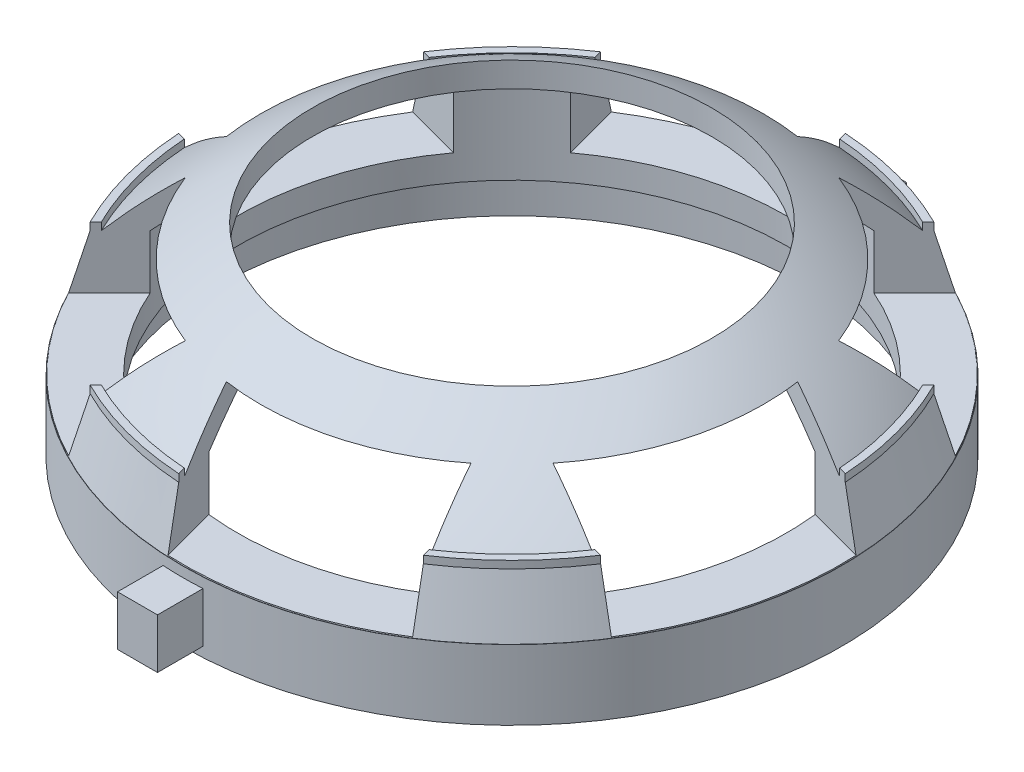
from build123d import *

# Parameters (mm, degrees)
BOSS_EXTRUDE1_REACH      = 18.085
BOSS_EXTRUDE1_END_RADIUS = 6.6
SKETCH2_W                = 0.8
SKETCH2_H                = 1
SKETCH3_W                = 0.8
SKETCH3_H                = 1
BOSS_EXTRUDE2_DEPTH      = 1
SKETCH7_W                = 2
SKETCH7_H                = 4
CUT_EXTRUDE2_DEPTH       = 10
CIRPATTERN4_COUNT        = 6


with BuildPart() as part:
    # Sketch1 → Revolve2 (revolve)
    with BuildSketch(Plane.XY, mode=Mode.PRIVATE) as revolve2_sk:
        with BuildLine():
            Line((5.9, 0), (6.6, 0))
            Line((6.6, 0), (6.6, 1.4))
            Line((6.6, 1.4), (6.594744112, 1.4))
            Line((6.594744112, 1.4), (6.3, 2.5))
            Line((6.3, 2.5), (6.3, 2.65))
            Line((6.3, 2.65), (6.15, 2.65))
            Line((6.15, 2.65), (6.15, 2.5))
            ThreePointArc((6.15, 2.5), (5.133391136, 3.353364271), (4, 4.044123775))
            Line((4, 4.044123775), (4, 3.545204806))
            ThreePointArc((4, 3.545204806), (4.778662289, 3.063736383), (5.5, 2.5))
            Line((5.5, 2.5), (5.5, 0.9))
            Line((5.5, 0.9), (5.9, 0.9))
            Line((5.9, 0.9), (5.9, 0))
        make_face()
    revolve(revolve2_sk.sketch.rotate(Axis((0, 0, 0), (0, 1, 0)), 90), axis=Axis((0, 0, 0), (0, 1, 0)))

    # Boss-Extrude1: up to this cylinder (the profile starts outside it)
    boss_extrude1_end = Plane(origin=(0, 0.7, 0), z_dir=(0, -1, 0)) * Cylinder(BOSS_EXTRUDE1_END_RADIUS, 50.37, mode=Mode.PRIVATE)
    # Sketch2 → Boss-Extrude1 (add, up to the surface)
    with BuildSketch(Plane.XY.offset(-7.5), mode=Mode.PRIVATE) as boss_extrude1_sk1:
        with Locations((0, 0.7)):
            Rectangle(SKETCH2_W, SKETCH2_H)
    boss_extrude1_tool1 = extrude(boss_extrude1_sk1.sketch, amount=BOSS_EXTRUDE1_REACH, mode=Mode.PRIVATE) - boss_extrude1_end
    add(boss_extrude1_tool1.solids().sort_by_distance((0, 0.7, -7.5))[0])

    # Sketch3 → Boss-Extrude2 (add)
    with BuildSketch(Plane.XY.offset(7.5)):
        with Locations((0, 0.7)):
            Rectangle(SKETCH3_W, SKETCH3_H)
    extrude(amount=-BOSS_EXTRUDE2_DEPTH)

    # Sketch7 → Cut-Extrude2 (cut)
    with BuildSketch(Plane(origin=(0, 0, 0), x_dir=(0, 1, 0), z_dir=(0.7071067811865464, 0, -0.7071067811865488))):
        with Locations((2.42, 0)):
            Rectangle(SKETCH7_W, SKETCH7_H)
    cut_extrude2 = extrude(amount=-CUT_EXTRUDE2_DEPTH, mode=Mode.SUBTRACT)

    # CirPattern4: Cut-Extrude2 ×6 about axis
    cirpattern4_axis = Axis((0, 0, 0), (0, 1, 0))
    for i in range(1, CIRPATTERN4_COUNT):
        add(cut_extrude2.rotate(cirpattern4_axis, i * 360 / CIRPATTERN4_COUNT), mode=Mode.SUBTRACT)


solid = part.part
